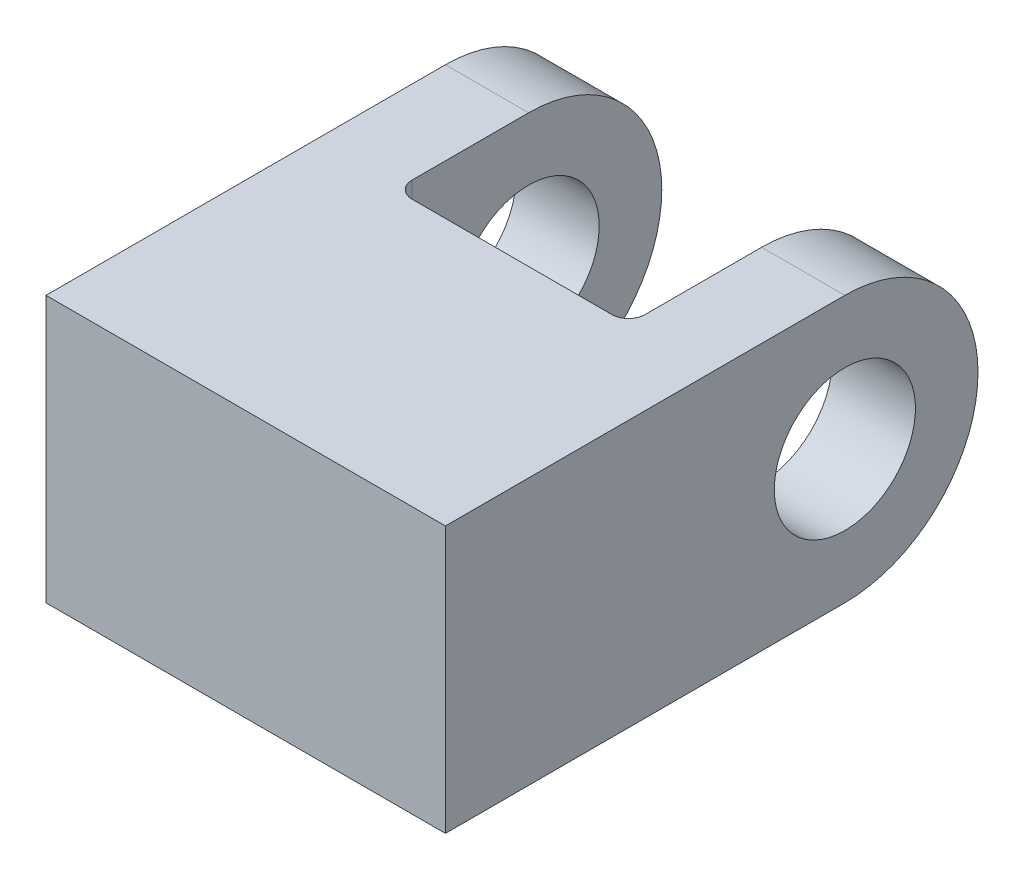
from build123d import *

# Parameters (mm, degrees)
SKETCH1_R           = 6.731
BOSS_EXTRUDE1_DEPTH = 19.05
SKETCH2_W           = 22.225
SKETCH2_H           = 28.575
CUT_EXTRUDE1_DEPTH  = 50.595085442
FILLET1_R           = 1.5875


with BuildPart() as part:
    # Sketch1 → Boss-Extrude1 (new, symmetric)
    with BuildSketch(Plane(origin=(0, 0, 0), x_dir=(0, 0, -1), z_dir=(1, 0, 0))):
        with BuildLine():
            Line((0, 12.7), (-38.1, 12.7))
            Line((-38.1, 12.7), (-38.1, -12.7))
            Line((-38.1, -12.7), (0, -12.7))
            ThreePointArc((0, -12.7), (12.7, 0), (0, 12.7))
        make_face()
        with Locations(Location((0, 0, 0), (0, 0, 180))):
            Circle(SKETCH1_R, mode=Mode.SUBTRACT)
    extrude(amount=BOSS_EXTRUDE1_DEPTH, both=True)

    # Sketch2 → Cut-Extrude1 (cut, through all)
    with BuildSketch(Plane(origin=(0, 12.7, 0), x_dir=(1, 0, 0), z_dir=(0, 1, 0))):
        with Locations((0, 1.5875)):
            Rectangle(SKETCH2_W, SKETCH2_H)
    extrude(amount=-CUT_EXTRUDE1_DEPTH, mode=Mode.SUBTRACT)

    # Fillet1
    fillet1_edges = [part.edges().sort_by_distance(p)[0] for p in [
        (-11.1125, 0, 12.7),
        (11.1125, 0, 12.7),
    ]]
    fillet(fillet1_edges, radius=FILLET1_R)


solid = part.part
